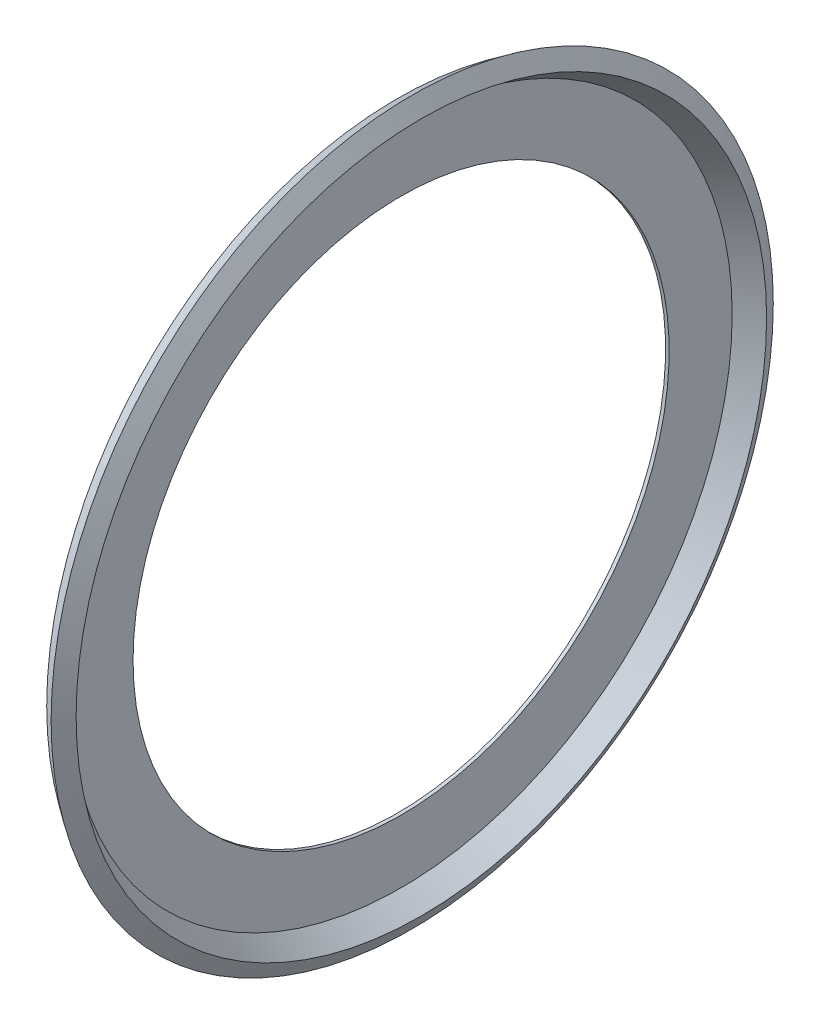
from build123d import *


with BuildPart() as part:
    # Esquisse1 → R_volution1 (revolve)
    with BuildSketch(Plane.XY, mode=Mode.PRIVATE) as r_volution1_sk:
        Polygon((0, 14.729032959), (0, 11.254), (0.15, 11.254), (0.15, 13.898823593), (1, 14.494), (0.615484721, 15.16), align=None)
    revolve(r_volution1_sk.sketch.rotate(Axis((1, 0, 0), (-1, 0, 0)), 270), axis=Axis((1, 0, 0), (-1, 0, 0)))


solid = part.part
